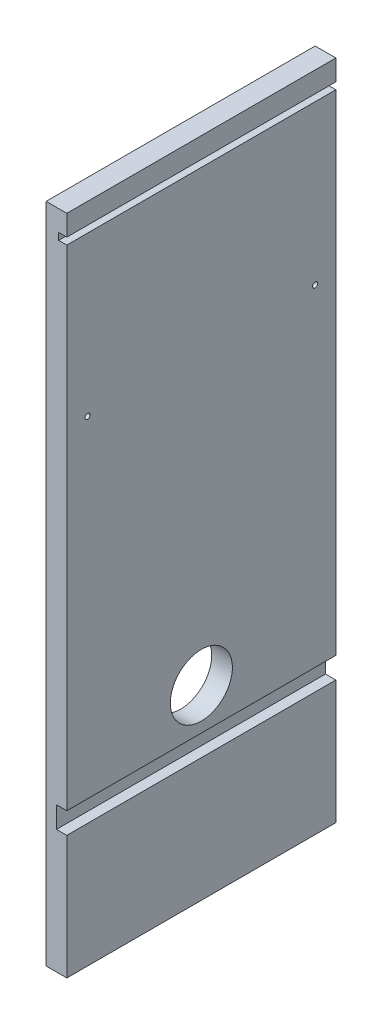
from build123d import *

# Parameters (mm, degrees)
BASE_EXTRUSION_DEPTH    = 130
ESQUISSE2_R             = 15
ESQUISSE2_R_2           = 1.25
ENL_V_MAT_EXTRU_1_DEPTH = 346.543050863
ESQUISSE4_R             = 2.5
ENL_V_MAT_EXTRU_2_DEPTH = 8


with BuildPart() as part:
    # Esquisse1 → Base-Extrusion (new body)
    with BuildSketch(Plane.XY):
        Polygon((-16.846079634, -13.3), (-16.846079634, -250), (-21.846079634, -250), (-21.846079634, -260.3), (-16.846079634, -260.3), (-16.846079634, -320), (-26.846079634, -320), (-26.846079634, 0), (-16.846079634, 0), (-16.846079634, -10), (-20.773902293, -10), (-20.773902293, -13.3), align=None)
    extrude(amount=BASE_EXTRUSION_DEPTH)

    # Esquisse2 → Enl_v. mat.-Extru.1 (cut, through all)
    with BuildSketch(Plane.ZY.offset(26.846079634)):
        with Locations(Location((65, -230, 0), (0, 0, 270))):
            Circle(ESQUISSE2_R)
        with Locations(Location((10, -90, 0), (0, 0, 270))):
            Circle(ESQUISSE2_R_2)
        with Locations(Location((120, -90, 0), (0, 0, 270))):
            Circle(ESQUISSE2_R_2)
    extrude(amount=-ENL_V_MAT_EXTRU_1_DEPTH, mode=Mode.SUBTRACT)

    # Esquisse4 → Enl_v. mat.-Extru.2 (cut)
    with BuildSketch(Plane.XZ.offset(320)):
        with Locations(Location((-21.468611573, 65, 0), (0, 0, 270))):
            Circle(ESQUISSE4_R)
    extrude(amount=-ENL_V_MAT_EXTRU_2_DEPTH, mode=Mode.SUBTRACT)


solid = part.part
